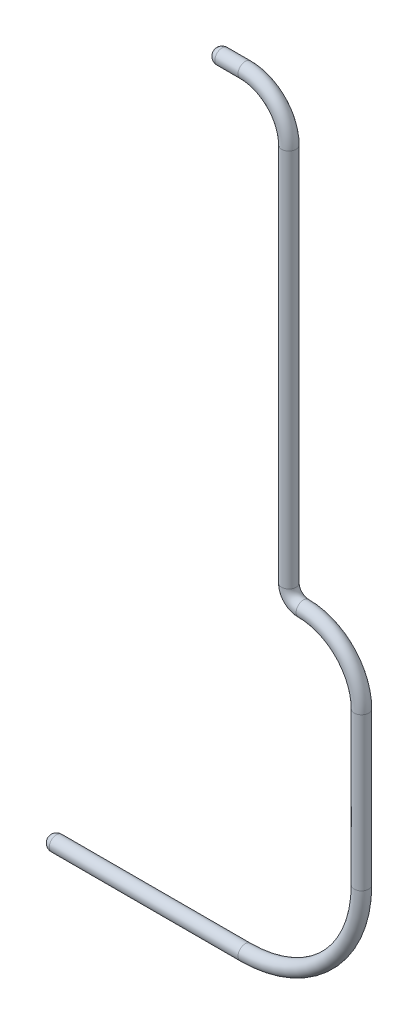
ISO-10303-21;
HEADER;
FILE_DESCRIPTION(('STEP AP214'),'2;1');
FILE_NAME('part.step','',(''),(''),'','','');
FILE_SCHEMA(('AUTOMOTIVE_DESIGN { 1 0 10303 214 1 1 1 1 }'));
ENDSEC;
DATA;
#1=APPLICATION_CONTEXT('core data for automotive mechanical design processes');
#2=APPLICATION_PROTOCOL_DEFINITION('international standard','automotive_design',2000,#1);
#3=PRODUCT_CONTEXT('',#1,'mechanical');
#4=PRODUCT('Part','Part','',(#3));
#5=PRODUCT_RELATED_PRODUCT_CATEGORY('part','',(#4));
#6=PRODUCT_DEFINITION_FORMATION('','',#4);
#7=PRODUCT_DEFINITION_CONTEXT('part definition',#1,'design');
#8=PRODUCT_DEFINITION('design','',#6,#7);
#9=PRODUCT_DEFINITION_SHAPE('','',#8);
#10=(LENGTH_UNIT() NAMED_UNIT(*) SI_UNIT(.MILLI.,.METRE.));
#11=(NAMED_UNIT(*) PLANE_ANGLE_UNIT() SI_UNIT($,.RADIAN.));
#12=(NAMED_UNIT(*) SI_UNIT($,.STERADIAN.) SOLID_ANGLE_UNIT());
#13=UNCERTAINTY_MEASURE_WITH_UNIT(LENGTH_MEASURE(1.E-05),#10,'distance_accuracy_value','');
#14=(GEOMETRIC_REPRESENTATION_CONTEXT(3) GLOBAL_UNCERTAINTY_ASSIGNED_CONTEXT((#13)) GLOBAL_UNIT_ASSIGNED_CONTEXT((#10,
#11,#12)) REPRESENTATION_CONTEXT('',''));
#15=CARTESIAN_POINT('',(0.,0.,0.));
#16=DIRECTION('',(0.,0.,1.));
#17=DIRECTION('',(1.,0.,0.));
#18=AXIS2_PLACEMENT_3D('',#15,#16,#17);
#19=CARTESIAN_POINT('',(65.,-147.5,0.));
#20=DIRECTION('',(-1.,0.,0.));
#21=DIRECTION('',(0.,0.,-1.));
#22=AXIS2_PLACEMENT_3D('',#19,#20,#21);
#23=CYLINDRICAL_SURFACE('',#22,2.5);
#24=CARTESIAN_POINT('',(0.,-147.5,0.));
#25=DIRECTION('',(1.,0.,0.));
#26=DIRECTION('',(0.,1.,0.));
#27=AXIS2_PLACEMENT_3D('',#24,#25,#26);
#28=CIRCLE('',#27,2.5);
#29=CARTESIAN_POINT('',(0.,-147.5,-2.5));
#30=VERTEX_POINT('',#29);
#31=CARTESIAN_POINT('',(0.,-147.5,2.5));
#32=VERTEX_POINT('',#31);
#33=EDGE_CURVE('E37',#30,#32,#28,.T.);
#34=ORIENTED_EDGE('',*,*,#33,.T.);
#35=CARTESIAN_POINT('',(0.,-147.5,0.));
#36=DIRECTION('',(-1.,0.,0.));
#37=DIRECTION('',(0.,-1.,0.));
#38=AXIS2_PLACEMENT_3D('',#35,#36,#37);
#39=CIRCLE('',#38,2.5);
#40=EDGE_CURVE('E46',#30,#32,#39,.T.);
#41=ORIENTED_EDGE('',*,*,#40,.F.);
#42=EDGE_LOOP('',(#34,#41));
#43=FACE_BOUND('',#42,.T.);
#44=CARTESIAN_POINT('',(65.,-147.5,0.));
#45=DIRECTION('',(-1.,0.,0.));
#46=DIRECTION('',(0.,-1.,0.));
#47=AXIS2_PLACEMENT_3D('',#44,#45,#46);
#48=CIRCLE('',#47,2.5);
#49=CARTESIAN_POINT('',(65.,-150.,0.));
#50=VERTEX_POINT('',#49);
#51=EDGE_CURVE('E11',#50,#50,#48,.T.);
#52=ORIENTED_EDGE('',*,*,#51,.T.);
#53=EDGE_LOOP('',(#52));
#54=FACE_BOUND('',#53,.T.);
#55=ADVANCED_FACE('F16',(#43,#54),#23,.T.);
#56=CARTESIAN_POINT('',(65.,-107.5,0.));
#57=DIRECTION('',(0.,0.,-1.));
#58=DIRECTION('',(-1.,0.,0.));
#59=AXIS2_PLACEMENT_3D('',#56,#57,#58);
#60=TOROIDAL_SURFACE('',#59,40.,2.5);
#61=CARTESIAN_POINT('',(105.,-107.5,0.));
#62=DIRECTION('',(0.,-1.,0.));
#63=DIRECTION('',(-1.,0.,0.));
#64=AXIS2_PLACEMENT_3D('',#61,#62,#63);
#65=CIRCLE('',#64,2.5);
#66=CARTESIAN_POINT('',(107.5,-107.5,0.));
#67=VERTEX_POINT('',#66);
#68=EDGE_CURVE('E24',#67,#67,#65,.T.);
#69=CARTESIAN_POINT('',(65.,-107.5,0.));
#70=DIRECTION('',(0.,0.,-1.));
#71=DIRECTION('',(-1.,0.,0.));
#72=AXIS2_PLACEMENT_3D('',#69,#70,#71);
#73=CIRCLE('',#72,42.5);
#74=EDGE_CURVE('',#67,#50,#73,.T.);
#75=ORIENTED_EDGE('',*,*,#68,.T.);
#76=ORIENTED_EDGE('',*,*,#51,.F.);
#77=ORIENTED_EDGE('',*,*,#74,.T.);
#78=ORIENTED_EDGE('',*,*,#74,.F.);
#79=EDGE_LOOP('',(#75,#77,#76,#78));
#80=FACE_BOUND('',#79,.T.);
#81=ADVANCED_FACE('F92',(#80),#60,.T.);
#82=CARTESIAN_POINT('',(105.,-55.,0.));
#83=DIRECTION('',(0.,-1.,0.));
#84=DIRECTION('',(0.,0.,-1.));
#85=AXIS2_PLACEMENT_3D('',#82,#83,#84);
#86=CYLINDRICAL_SURFACE('',#85,2.5);
#87=ORIENTED_EDGE('',*,*,#68,.F.);
#88=EDGE_LOOP('',(#87));
#89=FACE_BOUND('',#88,.T.);
#90=CARTESIAN_POINT('',(105.,-55.,0.));
#91=DIRECTION('',(0.,-1.,0.));
#92=DIRECTION('',(-1.,0.,0.));
#93=AXIS2_PLACEMENT_3D('',#90,#91,#92);
#94=CIRCLE('',#93,2.5);
#95=CARTESIAN_POINT('',(107.5,-55.,0.));
#96=VERTEX_POINT('',#95);
#97=EDGE_CURVE('E79',#96,#96,#94,.T.);
#98=ORIENTED_EDGE('',*,*,#97,.T.);
#99=EDGE_LOOP('',(#98));
#100=FACE_BOUND('',#99,.T.);
#101=ADVANCED_FACE('F94',(#89,#100),#86,.T.);
#102=CARTESIAN_POINT('',(85.,-55.,0.));
#103=DIRECTION('',(0.,0.,-1.));
#104=DIRECTION('',(-1.,0.,0.));
#105=AXIS2_PLACEMENT_3D('',#102,#103,#104);
#106=TOROIDAL_SURFACE('',#105,20.,2.5);
#107=CARTESIAN_POINT('',(85.,-35.,0.));
#108=DIRECTION('',(1.,0.,0.));
#109=DIRECTION('',(0.,-1.,0.));
#110=AXIS2_PLACEMENT_3D('',#107,#108,#109);
#111=CIRCLE('',#110,2.5);
#112=CARTESIAN_POINT('',(85.,-32.5,0.));
#113=VERTEX_POINT('',#112);
#114=EDGE_CURVE('E75',#113,#113,#111,.T.);
#115=CARTESIAN_POINT('',(85.,-55.,0.));
#116=DIRECTION('',(0.,0.,-1.));
#117=DIRECTION('',(-1.,0.,0.));
#118=AXIS2_PLACEMENT_3D('',#115,#116,#117);
#119=CIRCLE('',#118,22.5);
#120=EDGE_CURVE('',#113,#96,#119,.T.);
#121=ORIENTED_EDGE('',*,*,#114,.T.);
#122=ORIENTED_EDGE('',*,*,#97,.F.);
#123=ORIENTED_EDGE('',*,*,#120,.T.);
#124=ORIENTED_EDGE('',*,*,#120,.F.);
#125=EDGE_LOOP('',(#121,#123,#122,#124));
#126=FACE_BOUND('',#125,.T.);
#127=ADVANCED_FACE('F97',(#126),#106,.T.);
#128=CARTESIAN_POINT('',(85.,-30.,0.));
#129=DIRECTION('',(0.,0.,1.));
#130=DIRECTION('',(1.,0.,0.));
#131=AXIS2_PLACEMENT_3D('',#128,#129,#130);
#132=TOROIDAL_SURFACE('',#131,5.,2.5);
#133=ORIENTED_EDGE('',*,*,#114,.F.);
#134=EDGE_LOOP('',(#133));
#135=FACE_BOUND('',#134,.T.);
#136=CARTESIAN_POINT('',(80.,-30.,0.));
#137=DIRECTION('',(0.,-1.,0.));
#138=DIRECTION('',(-1.,0.,0.));
#139=AXIS2_PLACEMENT_3D('',#136,#137,#138);
#140=CIRCLE('',#139,2.5);
#141=CARTESIAN_POINT('',(77.5,-30.,0.));
#142=VERTEX_POINT('',#141);
#143=EDGE_CURVE('E71',#142,#142,#140,.T.);
#144=ORIENTED_EDGE('',*,*,#143,.T.);
#145=EDGE_LOOP('',(#144));
#146=FACE_BOUND('',#145,.T.);
#147=ADVANCED_FACE('F103',(#135,#146),#132,.T.);
#148=CARTESIAN_POINT('',(80.,100.58,0.));
#149=DIRECTION('',(0.,-1.,0.));
#150=DIRECTION('',(0.,0.,-1.));
#151=AXIS2_PLACEMENT_3D('',#148,#149,#150);
#152=CYLINDRICAL_SURFACE('',#151,2.5);
#153=ORIENTED_EDGE('',*,*,#143,.F.);
#154=EDGE_LOOP('',(#153));
#155=FACE_BOUND('',#154,.T.);
#156=CARTESIAN_POINT('',(80.,100.58,0.));
#157=DIRECTION('',(0.,-1.,0.));
#158=DIRECTION('',(-1.,0.,0.));
#159=AXIS2_PLACEMENT_3D('',#156,#157,#158);
#160=CIRCLE('',#159,2.5);
#161=CARTESIAN_POINT('',(82.5,100.58,0.));
#162=VERTEX_POINT('',#161);
#163=EDGE_CURVE('E67',#162,#162,#160,.T.);
#164=ORIENTED_EDGE('',*,*,#163,.T.);
#165=EDGE_LOOP('',(#164));
#166=FACE_BOUND('',#165,.T.);
#167=ADVANCED_FACE('F109',(#155,#166),#152,.T.);
#168=CARTESIAN_POINT('',(65.,100.58,0.));
#169=DIRECTION('',(0.,0.,-1.));
#170=DIRECTION('',(-1.,0.,0.));
#171=AXIS2_PLACEMENT_3D('',#168,#169,#170);
#172=TOROIDAL_SURFACE('',#171,15.,2.5);
#173=CARTESIAN_POINT('',(65.,115.58,0.));
#174=DIRECTION('',(1.,0.,0.));
#175=DIRECTION('',(0.,-1.,0.));
#176=AXIS2_PLACEMENT_3D('',#173,#174,#175);
#177=CIRCLE('',#176,2.5);
#178=CARTESIAN_POINT('',(65.,118.08,0.));
#179=VERTEX_POINT('',#178);
#180=EDGE_CURVE('E63',#179,#179,#177,.T.);
#181=CARTESIAN_POINT('',(65.,100.58,0.));
#182=DIRECTION('',(0.,0.,-1.));
#183=DIRECTION('',(-1.,0.,0.));
#184=AXIS2_PLACEMENT_3D('',#181,#182,#183);
#185=CIRCLE('',#184,17.5);
#186=EDGE_CURVE('',#179,#162,#185,.T.);
#187=ORIENTED_EDGE('',*,*,#180,.T.);
#188=ORIENTED_EDGE('',*,*,#163,.F.);
#189=ORIENTED_EDGE('',*,*,#186,.T.);
#190=ORIENTED_EDGE('',*,*,#186,.F.);
#191=EDGE_LOOP('',(#187,#189,#188,#190));
#192=FACE_BOUND('',#191,.T.);
#193=ADVANCED_FACE('F115',(#192),#172,.T.);
#194=CARTESIAN_POINT('',(57.,115.58,0.));
#195=DIRECTION('',(1.,0.,0.));
#196=DIRECTION('',(0.,0.,-1.));
#197=AXIS2_PLACEMENT_3D('',#194,#195,#196);
#198=CYLINDRICAL_SURFACE('',#197,2.5);
#199=ORIENTED_EDGE('',*,*,#180,.F.);
#200=EDGE_LOOP('',(#199));
#201=FACE_BOUND('',#200,.T.);
#202=CARTESIAN_POINT('',(57.,115.58,0.));
#203=DIRECTION('',(1.,0.,0.));
#204=DIRECTION('',(0.,1.,0.));
#205=AXIS2_PLACEMENT_3D('',#202,#203,#204);
#206=CIRCLE('',#205,2.5);
#207=CARTESIAN_POINT('',(57.,115.58,-2.5));
#208=VERTEX_POINT('',#207);
#209=CARTESIAN_POINT('',(57.,115.58,2.5));
#210=VERTEX_POINT('',#209);
#211=EDGE_CURVE('E42',#208,#210,#206,.T.);
#212=ORIENTED_EDGE('',*,*,#211,.T.);
#213=CARTESIAN_POINT('',(57.,115.58,0.));
#214=DIRECTION('',(-1.,0.,0.));
#215=DIRECTION('',(0.,-1.,0.));
#216=AXIS2_PLACEMENT_3D('',#213,#214,#215);
#217=CIRCLE('',#216,2.5);
#218=EDGE_CURVE('E30',#208,#210,#217,.T.);
#219=ORIENTED_EDGE('',*,*,#218,.F.);
#220=EDGE_LOOP('',(#212,#219));
#221=FACE_BOUND('',#220,.T.);
#222=ADVANCED_FACE('F48',(#201,#221),#198,.T.);
#223=CARTESIAN_POINT('',(0.,-147.5,0.));
#224=DIRECTION('',(0.,0.,1.));
#225=DIRECTION('',(0.,1.,0.));
#226=AXIS2_PLACEMENT_3D('',#223,#224,#225);
#227=SPHERICAL_SURFACE('',#226,2.5);
#228=CARTESIAN_POINT('',(0.,-147.5,0.));
#229=DIRECTION('',(1.,0.,0.));
#230=DIRECTION('',(0.,1.,0.));
#231=AXIS2_PLACEMENT_3D('',#228,#229,#230);
#232=SPHERICAL_SURFACE('',#231,2.5);
#233=ORIENTED_EDGE('',*,*,#33,.F.);
#234=ORIENTED_EDGE('',*,*,#40,.T.);
#235=EDGE_LOOP('',(#233,#234));
#236=FACE_BOUND('',#235,.T.);
#237=ADVANCED_FACE('F125',(#236),#232,.T.);
#238=CARTESIAN_POINT('',(57.,115.58,0.));
#239=DIRECTION('',(0.,0.,1.));
#240=DIRECTION('',(0.,1.,0.));
#241=AXIS2_PLACEMENT_3D('',#238,#239,#240);
#242=SPHERICAL_SURFACE('',#241,2.5);
#243=CARTESIAN_POINT('',(57.,115.58,0.));
#244=DIRECTION('',(1.,0.,0.));
#245=DIRECTION('',(0.,1.,0.));
#246=AXIS2_PLACEMENT_3D('',#243,#244,#245);
#247=SPHERICAL_SURFACE('',#246,2.5);
#248=ORIENTED_EDGE('',*,*,#211,.F.);
#249=ORIENTED_EDGE('',*,*,#218,.T.);
#250=EDGE_LOOP('',(#248,#249));
#251=FACE_BOUND('',#250,.T.);
#252=ADVANCED_FACE('F43',(#251),#247,.T.);
#253=CLOSED_SHELL('',(#55,#81,#101,#127,#147,#167,#193,#222,#237,#252));
#254=MANIFOLD_SOLID_BREP('B1',#253);
#255=ADVANCED_BREP_SHAPE_REPRESENTATION('',(#18,#254),#14);
#256=SHAPE_DEFINITION_REPRESENTATION(#9,#255);
ENDSEC;
END-ISO-10303-21;
